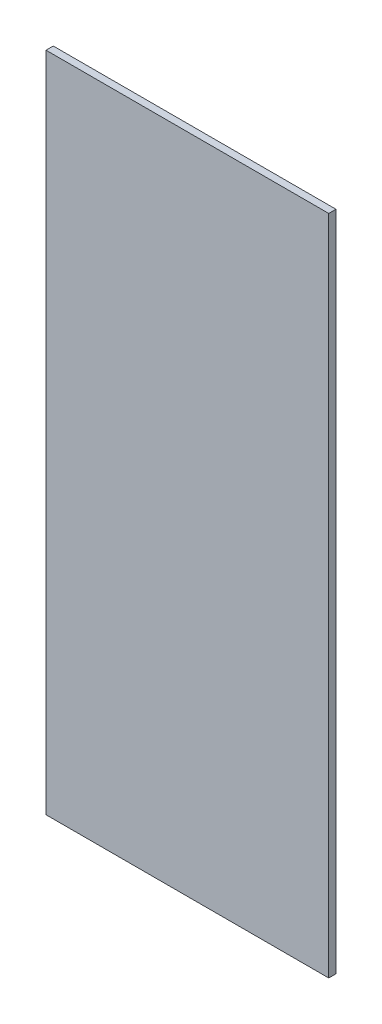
from build123d import *

# Parameters (mm, degrees)
CROQUIS1_W              = 585
CROQUIS1_H              = 1370
SALIENTE_EXTRUIR1_DEPTH = 15


with BuildPart() as part:
    # Croquis1 → Saliente-Extruir1 (new body)
    with BuildSketch(Plane.XY):
        Rectangle(CROQUIS1_W, CROQUIS1_H)
    extrude(amount=SALIENTE_EXTRUIR1_DEPTH)


solid = part.part
